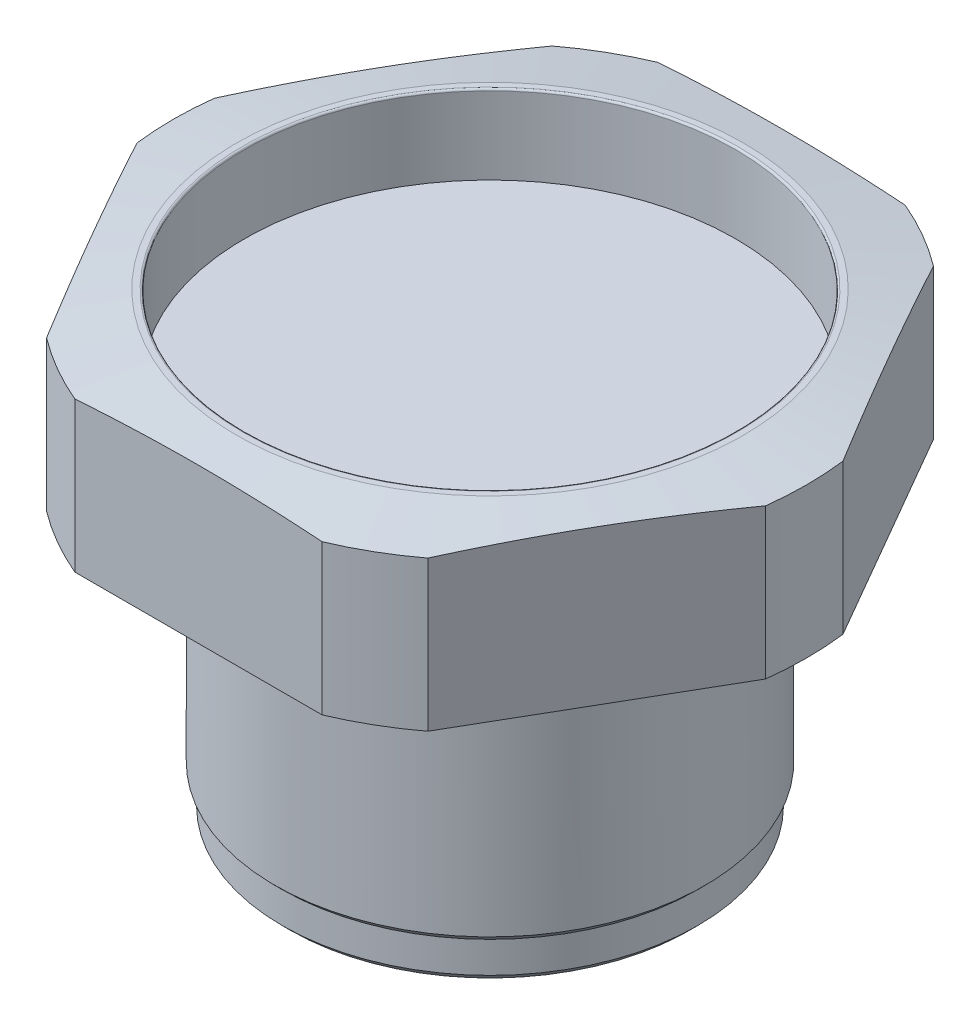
ISO-10303-21;
HEADER;
FILE_DESCRIPTION(('STEP AP214'),'2;1');
FILE_NAME('part.step','',(''),(''),'','','');
FILE_SCHEMA(('AUTOMOTIVE_DESIGN { 1 0 10303 214 1 1 1 1 }'));
ENDSEC;
DATA;
#1=APPLICATION_CONTEXT('core data for automotive mechanical design processes');
#2=APPLICATION_PROTOCOL_DEFINITION('international standard','automotive_design',2000,#1);
#3=PRODUCT_CONTEXT('',#1,'mechanical');
#4=PRODUCT('Part','Part','',(#3));
#5=PRODUCT_RELATED_PRODUCT_CATEGORY('part','',(#4));
#6=PRODUCT_DEFINITION_FORMATION('','',#4);
#7=PRODUCT_DEFINITION_CONTEXT('part definition',#1,'design');
#8=PRODUCT_DEFINITION('design','',#6,#7);
#9=PRODUCT_DEFINITION_SHAPE('','',#8);
#10=(LENGTH_UNIT() NAMED_UNIT(*) SI_UNIT(.MILLI.,.METRE.));
#11=(NAMED_UNIT(*) PLANE_ANGLE_UNIT() SI_UNIT($,.RADIAN.));
#12=(NAMED_UNIT(*) SI_UNIT($,.STERADIAN.) SOLID_ANGLE_UNIT());
#13=UNCERTAINTY_MEASURE_WITH_UNIT(LENGTH_MEASURE(1.E-05),#10,'distance_accuracy_value','');
#14=(GEOMETRIC_REPRESENTATION_CONTEXT(3) GLOBAL_UNCERTAINTY_ASSIGNED_CONTEXT((#13)) GLOBAL_UNIT_ASSIGNED_CONTEXT((#10,
#11,#12)) REPRESENTATION_CONTEXT('',''));
#15=CARTESIAN_POINT('',(0.,0.,0.));
#16=DIRECTION('',(0.,0.,1.));
#17=DIRECTION('',(1.,0.,0.));
#18=AXIS2_PLACEMENT_3D('',#15,#16,#17);
#19=CARTESIAN_POINT('',(27.0499967,-38.354,0.));
#20=DIRECTION('',(0.,-1.,0.));
#21=DIRECTION('',(0.,0.,-1.));
#22=AXIS2_PLACEMENT_3D('',#19,#20,#21);
#23=PLANE('',#22);
#24=CARTESIAN_POINT('',(0.,-38.354,0.));
#25=DIRECTION('',(0.,-1.,0.));
#26=DIRECTION('',(0.,0.,-1.));
#27=AXIS2_PLACEMENT_3D('',#24,#25,#26);
#28=CIRCLE('',#27,23.7209044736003);
#29=CARTESIAN_POINT('',(0.,-38.354,-23.7209044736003));
#30=VERTEX_POINT('',#29);
#31=EDGE_CURVE('E207',#30,#30,#28,.T.);
#32=ORIENTED_EDGE('',*,*,#31,.F.);
#33=EDGE_LOOP('',(#32));
#34=FACE_BOUND('',#33,.T.);
#35=CARTESIAN_POINT('',(0.,-38.354,0.));
#36=DIRECTION('',(0.,-1.,0.));
#37=DIRECTION('',(0.,0.,-1.));
#38=AXIS2_PLACEMENT_3D('',#35,#36,#37);
#39=CIRCLE('',#38,26.0339967);
#40=CARTESIAN_POINT('',(0.,-38.354,-26.0339967));
#41=VERTEX_POINT('',#40);
#42=EDGE_CURVE('E188',#41,#41,#39,.T.);
#43=ORIENTED_EDGE('',*,*,#42,.T.);
#44=EDGE_LOOP('',(#43));
#45=FACE_BOUND('',#44,.T.);
#46=ADVANCED_FACE('F41',(#34,#45),#23,.T.);
#47=CARTESIAN_POINT('',(0.,-8.96894233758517,0.));
#48=DIRECTION('',(0.,-1.,0.));
#49=DIRECTION('',(0.,0.,-1.));
#50=AXIS2_PLACEMENT_3D('',#47,#48,#49);
#51=CYLINDRICAL_SURFACE('',#50,27.0499967);
#52=CARTESIAN_POINT('',(0.,-0.508000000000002,0.));
#53=DIRECTION('',(0.,-1.,0.));
#54=DIRECTION('',(0.,0.,-1.));
#55=AXIS2_PLACEMENT_3D('',#52,#53,#54);
#56=CIRCLE('',#55,27.0499967);
#57=CARTESIAN_POINT('',(0.,-0.508000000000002,-27.0499967));
#58=VERTEX_POINT('',#57);
#59=EDGE_CURVE('E201',#58,#58,#56,.T.);
#60=ORIENTED_EDGE('',*,*,#59,.T.);
#61=EDGE_LOOP('',(#60));
#62=FACE_BOUND('',#61,.T.);
#63=CARTESIAN_POINT('',(0.,-5.08,0.));
#64=DIRECTION('',(0.,-1.,0.));
#65=DIRECTION('',(1.,0.,0.));
#66=AXIS2_PLACEMENT_3D('',#63,#64,#65);
#67=CIRCLE('',#66,27.0499967);
#68=CARTESIAN_POINT('',(27.0499967,-5.08,0.));
#69=VERTEX_POINT('',#68);
#70=EDGE_CURVE('E197',#69,#69,#67,.T.);
#71=ORIENTED_EDGE('',*,*,#70,.F.);
#72=EDGE_LOOP('',(#71));
#73=FACE_BOUND('',#72,.T.);
#74=ADVANCED_FACE('F228',(#62,#73),#51,.T.);
#75=CARTESIAN_POINT('',(0.,19.5502207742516,0.));
#76=DIRECTION('',(0.,-1.,0.));
#77=DIRECTION('',(0.,0.,-1.));
#78=AXIS2_PLACEMENT_3D('',#75,#76,#77);
#79=CONICAL_SURFACE('',#78,41.275,1.39626340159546);
#80=CARTESIAN_POINT('',(0.,21.0058,0.));
#81=DIRECTION('',(0.,-1.,0.));
#82=DIRECTION('',(0.,0.,-1.));
#83=AXIS2_PLACEMENT_3D('',#80,#81,#82);
#84=CIRCLE('',#83,33.02);
#85=CARTESIAN_POINT('',(0.,21.0058,-33.02));
#86=VERTEX_POINT('',#85);
#87=EDGE_CURVE('E405',#86,#86,#84,.T.);
#88=ORIENTED_EDGE('',*,*,#87,.T.);
#89=EDGE_LOOP('',(#88));
#90=FACE_BOUND('',#89,.T.);
#91=CARTESIAN_POINT('',(0.,19.5502207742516,0.));
#92=DIRECTION('',(0.,-1.,0.));
#93=DIRECTION('',(0.,0.,-1.));
#94=AXIS2_PLACEMENT_3D('',#91,#92,#93);
#95=CIRCLE('',#94,41.275);
#96=CARTESIAN_POINT('',(-40.9659173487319,19.5502207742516,5.04174977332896));
#97=VERTEX_POINT('',#96);
#98=CARTESIAN_POINT('',(-40.9659173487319,19.5502207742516,-5.04174977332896));
#99=VERTEX_POINT('',#98);
#100=EDGE_CURVE('E146',#97,#99,#95,.T.);
#101=ORIENTED_EDGE('',*,*,#100,.F.);
#102=CARTESIAN_POINT('',(-40.9673696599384,19.5500207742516,5.0392342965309));
#103=CARTESIAN_POINT('',(-40.6318536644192,19.5962299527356,5.62036504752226));
#104=CARTESIAN_POINT('',(-40.2962544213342,19.640002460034,6.20163998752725));
#105=CARTESIAN_POINT('',(-39.6248953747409,19.7223985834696,7.36446796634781));
#106=CARTESIAN_POINT('',(-39.2891355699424,19.7610221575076,7.94602100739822));
#107=CARTESIAN_POINT('',(-38.2816022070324,19.8687583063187,9.691119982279));
#108=CARTESIAN_POINT('',(-37.609604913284,19.9297320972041,10.8550534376));
#109=CARTESIAN_POINT('',(-36.2660437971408,20.0280404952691,13.182169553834));
#110=CARTESIAN_POINT('',(-35.5944805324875,20.0654054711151,14.3453512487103));
#111=CARTESIAN_POINT('',(-34.251138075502,20.1153717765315,16.6720886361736));
#112=CARTESIAN_POINT('',(-33.5793588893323,20.127973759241,17.8356443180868));
#113=CARTESIAN_POINT('',(-32.2358005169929,20.127973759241,20.1627556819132));
#114=CARTESIAN_POINT('',(-31.5640213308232,20.1153717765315,21.3263113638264));
#115=CARTESIAN_POINT('',(-30.2206788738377,20.0654054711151,23.6530487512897));
#116=CARTESIAN_POINT('',(-29.5491156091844,20.0280404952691,24.816230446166));
#117=CARTESIAN_POINT('',(-28.2055544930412,19.9297320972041,27.1433465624));
#118=CARTESIAN_POINT('',(-27.5335571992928,19.8687583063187,28.307280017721));
#119=CARTESIAN_POINT('',(-26.5260238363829,19.7610221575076,30.0523789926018));
#120=CARTESIAN_POINT('',(-26.1902640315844,19.7223985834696,30.6339320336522));
#121=CARTESIAN_POINT('',(-25.5189049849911,19.640002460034,31.7967600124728));
#122=CARTESIAN_POINT('',(-25.183305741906,19.5962299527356,32.3780349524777));
#123=CARTESIAN_POINT('',(-24.8477897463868,19.5500207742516,32.9591657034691));
#124=B_SPLINE_CURVE_WITH_KNOTS('',3,(#102,#103,#104,#105,#106,#107,#108,#109,#110,#111,#112,
#113,#114,#115,#116,#117,#118,#119,#120,#121,#122,#123),.UNSPECIFIED.,.F.,.F.,(4,2,2,2,2,2,2,2,
2,2,4),(0.,2.01785524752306,4.03572699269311,8.07165217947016,12.1023752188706,16.132991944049,
20.1636086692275,24.1943317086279,28.230256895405,30.248128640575,32.2659838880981),.UNSPECIFIED.);
#125=CARTESIAN_POINT('',(-24.8492420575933,19.5502207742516,32.956650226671));
#126=VERTEX_POINT('',#125);
#127=EDGE_CURVE('E404',#97,#126,#124,.T.);
#128=ORIENTED_EDGE('',*,*,#127,.T.);
#129=CARTESIAN_POINT('',(-16.1166752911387,19.5502207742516,37.9984));
#130=VERTEX_POINT('',#129);
#131=EDGE_CURVE('E396',#130,#126,#95,.T.);
#132=ORIENTED_EDGE('',*,*,#131,.F.);
#133=CARTESIAN_POINT('',(-57.8639051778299,14.6218698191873,37.9984));
#134=CARTESIAN_POINT('',(-57.0019930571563,14.7489031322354,37.9984));
#135=CARTESIAN_POINT('',(-56.139958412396,14.8751046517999,37.9984));
#136=CARTESIAN_POINT('',(-54.4156199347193,15.125664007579,37.9984));
#137=CARTESIAN_POINT('',(-53.5533161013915,15.2500218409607,37.9984));
#138=CARTESIAN_POINT('',(-50.9659374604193,15.6200635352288,37.9984));
#139=CARTESIAN_POINT('',(-49.2404266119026,15.8627109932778,37.9984));
#140=CARTESIAN_POINT('',(-45.7873021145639,16.3382293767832,37.9984));
#141=CARTESIAN_POINT('',(-44.0596878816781,16.5710960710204,37.9984));
#142=CARTESIAN_POINT('',(-40.6028670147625,17.0246892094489,37.9984));
#143=CARTESIAN_POINT('',(-38.8736603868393,17.245415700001,37.9984));
#144=CARTESIAN_POINT('',(-35.419217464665,17.6711956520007,37.9984));
#145=CARTESIAN_POINT('',(-33.6939873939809,17.8762993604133,37.9984));
#146=CARTESIAN_POINT('',(-30.2414345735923,18.2682133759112,37.9984));
#147=CARTESIAN_POINT('',(-28.5141118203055,18.4550236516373,37.9984));
#148=CARTESIAN_POINT('',(-25.0572784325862,18.8062070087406,37.9984));
#149=CARTESIAN_POINT('',(-23.3277679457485,18.9705815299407,37.9984));
#150=CARTESIAN_POINT('',(-19.8663595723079,19.2721663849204,37.9984));
#151=CARTESIAN_POINT('',(-18.1344616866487,19.4093767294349,37.9984));
#152=CARTESIAN_POINT('',(-14.6602163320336,19.6521327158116,37.9984));
#153=CARTESIAN_POINT('',(-12.9178580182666,19.7575264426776,37.9984));
#154=CARTESIAN_POINT('',(-10.3029433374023,19.8876204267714,37.9984));
#155=CARTESIAN_POINT('',(-9.43107075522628,19.9263191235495,37.9984));
#156=CARTESIAN_POINT('',(-7.68694739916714,19.9938955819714,37.9984));
#157=CARTESIAN_POINT('',(-6.81469662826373,20.0227734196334,37.9984));
#158=CARTESIAN_POINT('',(-5.0700654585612,20.0703033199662,37.9984));
#159=CARTESIAN_POINT('',(-4.19768510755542,20.0889571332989,37.9984));
#160=CARTESIAN_POINT('',(-2.45276864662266,20.1157789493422,37.9984));
#161=CARTESIAN_POINT('',(-1.58023253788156,20.1239470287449,37.9984));
#162=CARTESIAN_POINT('',(0.164877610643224,20.1296767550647,37.9984));
#163=CARTESIAN_POINT('',(1.03745165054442,20.1272383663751,37.9984));
#164=CARTESIAN_POINT('',(2.78250560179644,20.1117916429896,37.9984));
#165=CARTESIAN_POINT('',(3.65498551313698,20.0987833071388,37.9984));
#166=CARTESIAN_POINT('',(5.40109406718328,20.0623572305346,37.9984));
#167=CARTESIAN_POINT('',(6.27472237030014,20.0389232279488,37.9984));
#168=CARTESIAN_POINT('',(8.0216525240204,19.9819781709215,37.9984));
#169=CARTESIAN_POINT('',(8.89495437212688,19.9484670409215,37.9984));
#170=CARTESIAN_POINT('',(11.5142177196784,19.833470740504,37.9984));
#171=CARTESIAN_POINT('',(13.2595585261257,19.7375221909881,37.9984));
#172=CARTESIAN_POINT('',(16.748434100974,19.5116068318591,37.9984));
#173=CARTESIAN_POINT('',(18.4919682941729,19.3816313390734,37.9984));
#174=CARTESIAN_POINT('',(21.9766261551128,19.0928384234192,37.9984));
#175=CARTESIAN_POINT('',(23.7177498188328,18.9340209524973,37.9984));
#176=CARTESIAN_POINT('',(27.1033127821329,18.6017526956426,37.9984));
#177=CARTESIAN_POINT('',(28.7478770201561,18.4295617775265,37.9984));
#178=CARTESIAN_POINT('',(32.0350715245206,18.0675285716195,37.9984));
#179=CARTESIAN_POINT('',(33.6777017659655,17.8776860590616,37.9984));
#180=CARTESIAN_POINT('',(36.9612926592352,17.4835029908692,37.9984));
#181=CARTESIAN_POINT('',(38.6022532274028,17.279161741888,37.9984));
#182=CARTESIAN_POINT('',(41.8826385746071,16.8585980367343,37.9984));
#183=CARTESIAN_POINT('',(43.5220633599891,16.6423756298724,37.9984));
#184=CARTESIAN_POINT('',(46.7998380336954,16.2001333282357,37.9984));
#185=CARTESIAN_POINT('',(48.4381877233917,15.974111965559,37.9984));
#186=CARTESIAN_POINT('',(51.7137535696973,15.5140087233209,37.9984));
#187=CARTESIAN_POINT('',(53.3509697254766,15.2799268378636,37.9984));
#188=CARTESIAN_POINT('',(56.624382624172,14.805081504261,37.9984));
#189=CARTESIAN_POINT('',(58.2605793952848,14.5643182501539,37.9984));
#190=CARTESIAN_POINT('',(61.5321396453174,14.0772070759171,37.9984));
#191=CARTESIAN_POINT('',(63.1675031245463,13.8308591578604,37.9984));
#192=CARTESIAN_POINT('',(66.430533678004,13.3345330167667,37.9984));
#193=CARTESIAN_POINT('',(68.0582037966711,13.0845747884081,37.9984));
#194=CARTESIAN_POINT('',(71.3129338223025,12.5807143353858,37.9984));
#195=CARTESIAN_POINT('',(72.9399937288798,12.3268121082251,37.9984));
#196=CARTESIAN_POINT('',(77.8204109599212,11.5600905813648,37.9984));
#197=CARTESIAN_POINT('',(81.07298140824,11.0422601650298,37.9984));
#198=CARTESIAN_POINT('',(85.9496272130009,10.2582808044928,37.9984));
#199=CARTESIAN_POINT('',(87.5742999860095,9.99583189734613,37.9984));
#200=CARTESIAN_POINT('',(90.8232964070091,9.46877892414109,37.9984));
#201=CARTESIAN_POINT('',(92.4476200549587,9.20417485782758,37.9984));
#202=CARTESIAN_POINT('',(95.6959355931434,8.67309809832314,37.9984));
#203=CARTESIAN_POINT('',(97.3199274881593,8.40662543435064,37.9984));
#204=CARTESIAN_POINT('',(100.567638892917,7.87203038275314,37.9984));
#205=CARTESIAN_POINT('',(102.191358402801,7.60390799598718,37.9984));
#206=CARTESIAN_POINT('',(103.814959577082,7.33507210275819,37.9984));
#207=B_SPLINE_CURVE_WITH_KNOTS('',3,(#133,#134,#135,#136,#137,#138,#139,#140,#141,#142,#143,
#144,#145,#146,#147,#148,#149,#150,#151,#152,#153,#154,#155,#156,#157,#158,#159,#160,#161,#162,
#163,#164,#165,#166,#167,#168,#169,#170,#171,#172,#173,#174,#175,#176,#177,#178,#179,#180,#181,
#182,#183,#184,#185,#186,#187,#188,#189,#190,#191,#192,#193,#194,#195,#196,#197,#198,#199,#200,
#201,#202,#203,#204,#205,#206),.UNSPECIFIED.,.F.,.F.,(4,2,2,2,2,2,2,2,2,2,2,2,2,2,2,2,2,2,2,2,2,
2,2,2,2,2,2,2,2,2,2,2,2,2,2,2,4),(0.,2.6136690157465,5.22734204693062,10.454782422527,
15.6844614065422,20.9141204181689,26.1261792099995,31.3382469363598,36.549980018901,
41.7617110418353,46.9979466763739,49.6160934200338,52.2342198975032,54.8518979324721,
57.4695568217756,60.0872244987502,62.7048924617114,65.3266578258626,67.9484428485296,
73.1919483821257,78.4367932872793,83.681646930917,88.6421976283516,93.602811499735,
98.5636627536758,103.524493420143,108.486069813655,113.447649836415,118.409085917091,
123.37052015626,128.310767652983,133.251018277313,143.131593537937,148.068795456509,
153.005997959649,157.943123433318,162.880246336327),.UNSPECIFIED.);
#208=CARTESIAN_POINT('',(16.1166752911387,19.5502207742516,37.9984));
#209=VERTEX_POINT('',#208);
#210=EDGE_CURVE('E297',#130,#209,#207,.T.);
#211=ORIENTED_EDGE('',*,*,#210,.T.);
#212=CARTESIAN_POINT('',(24.8492420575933,19.5502207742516,32.956650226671));
#213=VERTEX_POINT('',#212);
#214=EDGE_CURVE('E366',#213,#209,#95,.T.);
#215=ORIENTED_EDGE('',*,*,#214,.F.);
#216=CARTESIAN_POINT('',(24.8477897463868,19.5500207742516,32.9591657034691));
#217=CARTESIAN_POINT('',(25.183305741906,19.5962299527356,32.3780349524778));
#218=CARTESIAN_POINT('',(25.5189049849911,19.640002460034,31.7967600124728));
#219=CARTESIAN_POINT('',(26.1902640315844,19.7223985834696,30.6339320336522));
#220=CARTESIAN_POINT('',(26.5260238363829,19.7610221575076,30.0523789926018));
#221=CARTESIAN_POINT('',(27.5335571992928,19.8687583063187,28.307280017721));
#222=CARTESIAN_POINT('',(28.2055544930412,19.9297320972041,27.1433465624));
#223=CARTESIAN_POINT('',(29.5491156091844,20.0280404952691,24.8162304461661));
#224=CARTESIAN_POINT('',(30.2206788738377,20.0654054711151,23.6530487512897));
#225=CARTESIAN_POINT('',(31.5640213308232,20.1153717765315,21.3263113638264));
#226=CARTESIAN_POINT('',(32.2358005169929,20.127973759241,20.1627556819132));
#227=CARTESIAN_POINT('',(33.5793588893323,20.127973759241,17.8356443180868));
#228=CARTESIAN_POINT('',(34.251138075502,20.1153717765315,16.6720886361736));
#229=CARTESIAN_POINT('',(35.5944805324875,20.0654054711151,14.3453512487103));
#230=CARTESIAN_POINT('',(36.2660437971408,20.0280404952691,13.182169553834));
#231=CARTESIAN_POINT('',(37.609604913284,19.9297320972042,10.8550534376));
#232=CARTESIAN_POINT('',(38.2816022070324,19.8687583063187,9.69111998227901));
#233=CARTESIAN_POINT('',(39.2891355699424,19.7610221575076,7.94602100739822));
#234=CARTESIAN_POINT('',(39.6248953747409,19.7223985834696,7.36446796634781));
#235=CARTESIAN_POINT('',(40.2962544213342,19.640002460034,6.20163998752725));
#236=CARTESIAN_POINT('',(40.6318536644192,19.5962299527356,5.62036504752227));
#237=CARTESIAN_POINT('',(40.9673696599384,19.5500207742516,5.0392342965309));
#238=B_SPLINE_CURVE_WITH_KNOTS('',3,(#216,#217,#218,#219,#220,#221,#222,#223,#224,#225,#226,
#227,#228,#229,#230,#231,#232,#233,#234,#235,#236,#237),.UNSPECIFIED.,.F.,.F.,(4,2,2,2,2,2,2,2,
2,2,4),(0.,2.01785524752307,4.03572699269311,8.07165217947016,12.1023752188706,16.132991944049,
20.1636086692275,24.1943317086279,28.230256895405,30.248128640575,32.2659838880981),.UNSPECIFIED.);
#239=CARTESIAN_POINT('',(40.9659173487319,19.5502207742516,5.04174977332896));
#240=VERTEX_POINT('',#239);
#241=EDGE_CURVE('E349',#213,#240,#238,.T.);
#242=ORIENTED_EDGE('',*,*,#241,.T.);
#243=CARTESIAN_POINT('',(40.9659173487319,19.5502207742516,-5.04174977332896));
#244=VERTEX_POINT('',#243);
#245=EDGE_CURVE('E169',#244,#240,#95,.T.);
#246=ORIENTED_EDGE('',*,*,#245,.F.);
#247=CARTESIAN_POINT('',(40.9673696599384,19.5500207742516,-5.0392342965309));
#248=CARTESIAN_POINT('',(40.6318536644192,19.5962299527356,-5.62036504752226));
#249=CARTESIAN_POINT('',(40.2962544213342,19.640002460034,-6.20163998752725));
#250=CARTESIAN_POINT('',(39.6248953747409,19.7223985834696,-7.36446796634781));
#251=CARTESIAN_POINT('',(39.2891355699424,19.7610221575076,-7.94602100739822));
#252=CARTESIAN_POINT('',(38.2816022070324,19.8687583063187,-9.691119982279));
#253=CARTESIAN_POINT('',(37.609604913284,19.9297320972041,-10.8550534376));
#254=CARTESIAN_POINT('',(36.2660437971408,20.0280404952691,-13.182169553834));
#255=CARTESIAN_POINT('',(35.5944805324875,20.0654054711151,-14.3453512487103));
#256=CARTESIAN_POINT('',(34.251138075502,20.1153717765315,-16.6720886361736));
#257=CARTESIAN_POINT('',(33.5793588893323,20.127973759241,-17.8356443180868));
#258=CARTESIAN_POINT('',(32.2358005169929,20.127973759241,-20.1627556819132));
#259=CARTESIAN_POINT('',(31.5640213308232,20.1153717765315,-21.3263113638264));
#260=CARTESIAN_POINT('',(30.2206788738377,20.0654054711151,-23.6530487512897));
#261=CARTESIAN_POINT('',(29.5491156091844,20.0280404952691,-24.816230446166));
#262=CARTESIAN_POINT('',(28.2055544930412,19.9297320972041,-27.1433465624));
#263=CARTESIAN_POINT('',(27.5335571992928,19.8687583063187,-28.307280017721));
#264=CARTESIAN_POINT('',(26.5260238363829,19.7610221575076,-30.0523789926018));
#265=CARTESIAN_POINT('',(26.1902640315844,19.7223985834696,-30.6339320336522));
#266=CARTESIAN_POINT('',(25.5189049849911,19.640002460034,-31.7967600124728));
#267=CARTESIAN_POINT('',(25.183305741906,19.5962299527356,-32.3780349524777));
#268=CARTESIAN_POINT('',(24.8477897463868,19.5500207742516,-32.9591657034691));
#269=B_SPLINE_CURVE_WITH_KNOTS('',3,(#247,#248,#249,#250,#251,#252,#253,#254,#255,#256,#257,
#258,#259,#260,#261,#262,#263,#264,#265,#266,#267,#268),.UNSPECIFIED.,.F.,.F.,(4,2,2,2,2,2,2,2,
2,2,4),(0.,2.01785524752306,4.03572699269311,8.07165217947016,12.1023752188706,16.132991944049,
20.1636086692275,24.1943317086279,28.230256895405,30.248128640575,32.2659838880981),.UNSPECIFIED.);
#270=CARTESIAN_POINT('',(24.8492420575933,19.5502207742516,-32.956650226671));
#271=VERTEX_POINT('',#270);
#272=EDGE_CURVE('E341',#244,#271,#269,.T.);
#273=ORIENTED_EDGE('',*,*,#272,.T.);
#274=CARTESIAN_POINT('',(16.1166752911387,19.5502207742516,-37.9984));
#275=VERTEX_POINT('',#274);
#276=EDGE_CURVE('E165',#275,#271,#95,.T.);
#277=ORIENTED_EDGE('',*,*,#276,.F.);
#278=CARTESIAN_POINT('',(-57.8639051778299,14.6218698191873,-37.9984));
#279=CARTESIAN_POINT('',(-57.0019930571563,14.7489031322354,-37.9984));
#280=CARTESIAN_POINT('',(-56.139958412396,14.8751046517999,-37.9984));
#281=CARTESIAN_POINT('',(-54.4156199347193,15.125664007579,-37.9984));
#282=CARTESIAN_POINT('',(-53.5533161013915,15.2500218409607,-37.9984));
#283=CARTESIAN_POINT('',(-50.9659374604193,15.6200635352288,-37.9984));
#284=CARTESIAN_POINT('',(-49.2404266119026,15.8627109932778,-37.9984));
#285=CARTESIAN_POINT('',(-45.7873021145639,16.3382293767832,-37.9984));
#286=CARTESIAN_POINT('',(-44.0596878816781,16.5710960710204,-37.9984));
#287=CARTESIAN_POINT('',(-40.6028670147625,17.0246892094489,-37.9984));
#288=CARTESIAN_POINT('',(-38.8736603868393,17.245415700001,-37.9984));
#289=CARTESIAN_POINT('',(-35.419217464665,17.6711956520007,-37.9984));
#290=CARTESIAN_POINT('',(-33.6939873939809,17.8762993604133,-37.9984));
#291=CARTESIAN_POINT('',(-30.2414345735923,18.2682133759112,-37.9984));
#292=CARTESIAN_POINT('',(-28.5141118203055,18.4550236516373,-37.9984));
#293=CARTESIAN_POINT('',(-25.0572784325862,18.8062070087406,-37.9984));
#294=CARTESIAN_POINT('',(-23.3277679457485,18.9705815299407,-37.9984));
#295=CARTESIAN_POINT('',(-19.8663595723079,19.2721663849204,-37.9984));
#296=CARTESIAN_POINT('',(-18.1344616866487,19.4093767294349,-37.9984));
#297=CARTESIAN_POINT('',(-14.6602163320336,19.6521327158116,-37.9984));
#298=CARTESIAN_POINT('',(-12.9178580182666,19.7575264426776,-37.9984));
#299=CARTESIAN_POINT('',(-10.3029433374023,19.8876204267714,-37.9984));
#300=CARTESIAN_POINT('',(-9.43107075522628,19.9263191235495,-37.9984));
#301=CARTESIAN_POINT('',(-7.68694739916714,19.9938955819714,-37.9984));
#302=CARTESIAN_POINT('',(-6.81469662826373,20.0227734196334,-37.9984));
#303=CARTESIAN_POINT('',(-5.0700654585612,20.0703033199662,-37.9984));
#304=CARTESIAN_POINT('',(-4.19768510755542,20.0889571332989,-37.9984));
#305=CARTESIAN_POINT('',(-2.45276864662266,20.1157789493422,-37.9984));
#306=CARTESIAN_POINT('',(-1.58023253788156,20.1239470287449,-37.9984));
#307=CARTESIAN_POINT('',(0.164877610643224,20.1296767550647,-37.9984));
#308=CARTESIAN_POINT('',(1.03745165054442,20.1272383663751,-37.9984));
#309=CARTESIAN_POINT('',(2.78250560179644,20.1117916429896,-37.9984));
#310=CARTESIAN_POINT('',(3.65498551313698,20.0987833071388,-37.9984));
#311=CARTESIAN_POINT('',(5.40109406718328,20.0623572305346,-37.9984));
#312=CARTESIAN_POINT('',(6.27472237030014,20.0389232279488,-37.9984));
#313=CARTESIAN_POINT('',(8.0216525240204,19.9819781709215,-37.9984));
#314=CARTESIAN_POINT('',(8.89495437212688,19.9484670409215,-37.9984));
#315=CARTESIAN_POINT('',(11.5142177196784,19.833470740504,-37.9984));
#316=CARTESIAN_POINT('',(13.2595585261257,19.7375221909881,-37.9984));
#317=CARTESIAN_POINT('',(16.748434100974,19.5116068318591,-37.9984));
#318=CARTESIAN_POINT('',(18.4919682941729,19.3816313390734,-37.9984));
#319=CARTESIAN_POINT('',(21.9766261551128,19.0928384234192,-37.9984));
#320=CARTESIAN_POINT('',(23.7177498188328,18.9340209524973,-37.9984));
#321=CARTESIAN_POINT('',(27.1033127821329,18.6017526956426,-37.9984));
#322=CARTESIAN_POINT('',(28.7478770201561,18.4295617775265,-37.9984));
#323=CARTESIAN_POINT('',(32.0350715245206,18.0675285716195,-37.9984));
#324=CARTESIAN_POINT('',(33.6777017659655,17.8776860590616,-37.9984));
#325=CARTESIAN_POINT('',(36.9612926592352,17.4835029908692,-37.9984));
#326=CARTESIAN_POINT('',(38.6022532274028,17.279161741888,-37.9984));
#327=CARTESIAN_POINT('',(41.8826385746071,16.8585980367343,-37.9984));
#328=CARTESIAN_POINT('',(43.5220633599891,16.6423756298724,-37.9984));
#329=CARTESIAN_POINT('',(46.7998380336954,16.2001333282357,-37.9984));
#330=CARTESIAN_POINT('',(48.4381877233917,15.974111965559,-37.9984));
#331=CARTESIAN_POINT('',(51.7137535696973,15.5140087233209,-37.9984));
#332=CARTESIAN_POINT('',(53.3509697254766,15.2799268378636,-37.9984));
#333=CARTESIAN_POINT('',(56.624382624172,14.805081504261,-37.9984));
#334=CARTESIAN_POINT('',(58.2605793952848,14.5643182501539,-37.9984));
#335=CARTESIAN_POINT('',(61.5321396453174,14.0772070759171,-37.9984));
#336=CARTESIAN_POINT('',(63.1675031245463,13.8308591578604,-37.9984));
#337=CARTESIAN_POINT('',(66.430533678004,13.3345330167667,-37.9984));
#338=CARTESIAN_POINT('',(68.0582037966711,13.0845747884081,-37.9984));
#339=CARTESIAN_POINT('',(71.3129338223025,12.5807143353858,-37.9984));
#340=CARTESIAN_POINT('',(72.9399937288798,12.3268121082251,-37.9984));
#341=CARTESIAN_POINT('',(77.8204109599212,11.5600905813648,-37.9984));
#342=CARTESIAN_POINT('',(81.07298140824,11.0422601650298,-37.9984));
#343=CARTESIAN_POINT('',(85.9496272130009,10.2582808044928,-37.9984));
#344=CARTESIAN_POINT('',(87.5742999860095,9.99583189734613,-37.9984));
#345=CARTESIAN_POINT('',(90.8232964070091,9.46877892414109,-37.9984));
#346=CARTESIAN_POINT('',(92.4476200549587,9.20417485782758,-37.9984));
#347=CARTESIAN_POINT('',(95.6959355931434,8.67309809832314,-37.9984));
#348=CARTESIAN_POINT('',(97.3199274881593,8.40662543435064,-37.9984));
#349=CARTESIAN_POINT('',(100.567638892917,7.87203038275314,-37.9984));
#350=CARTESIAN_POINT('',(102.191358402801,7.60390799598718,-37.9984));
#351=CARTESIAN_POINT('',(103.814959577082,7.33507210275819,-37.9984));
#352=B_SPLINE_CURVE_WITH_KNOTS('',3,(#278,#279,#280,#281,#282,#283,#284,#285,#286,#287,#288,
#289,#290,#291,#292,#293,#294,#295,#296,#297,#298,#299,#300,#301,#302,#303,#304,#305,#306,#307,
#308,#309,#310,#311,#312,#313,#314,#315,#316,#317,#318,#319,#320,#321,#322,#323,#324,#325,#326,
#327,#328,#329,#330,#331,#332,#333,#334,#335,#336,#337,#338,#339,#340,#341,#342,#343,#344,#345,
#346,#347,#348,#349,#350,#351),.UNSPECIFIED.,.F.,.F.,(4,2,2,2,2,2,2,2,2,2,2,2,2,2,2,2,2,2,2,2,2,
2,2,2,2,2,2,2,2,2,2,2,2,2,2,2,4),(0.,2.6136690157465,5.22734204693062,10.454782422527,
15.6844614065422,20.9141204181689,26.1261792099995,31.3382469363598,36.549980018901,
41.7617110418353,46.9979466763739,49.6160934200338,52.2342198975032,54.8518979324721,
57.4695568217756,60.0872244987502,62.7048924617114,65.3266578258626,67.9484428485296,
73.1919483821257,78.4367932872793,83.681646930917,88.6421976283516,93.602811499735,
98.5636627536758,103.524493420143,108.486069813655,113.447649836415,118.409085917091,
123.37052015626,128.310767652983,133.251018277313,143.131593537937,148.068795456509,
153.005997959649,157.943123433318,162.880246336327),.UNSPECIFIED.);
#353=CARTESIAN_POINT('',(-16.1166752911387,19.5502207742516,-37.9984));
#354=VERTEX_POINT('',#353);
#355=EDGE_CURVE('E331',#275,#354,#352,.F.);
#356=ORIENTED_EDGE('',*,*,#355,.T.);
#357=CARTESIAN_POINT('',(-24.8492420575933,19.5502207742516,-32.956650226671));
#358=VERTEX_POINT('',#357);
#359=EDGE_CURVE('E162',#358,#354,#95,.T.);
#360=ORIENTED_EDGE('',*,*,#359,.F.);
#361=CARTESIAN_POINT('',(-24.8477897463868,19.5500207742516,-32.9591657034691));
#362=CARTESIAN_POINT('',(-25.183305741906,19.5962299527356,-32.3780349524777));
#363=CARTESIAN_POINT('',(-25.5189049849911,19.640002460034,-31.7967600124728));
#364=CARTESIAN_POINT('',(-26.1902640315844,19.7223985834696,-30.6339320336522));
#365=CARTESIAN_POINT('',(-26.5260238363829,19.7610221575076,-30.0523789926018));
#366=CARTESIAN_POINT('',(-27.5335571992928,19.8687583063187,-28.307280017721));
#367=CARTESIAN_POINT('',(-28.2055544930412,19.9297320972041,-27.1433465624));
#368=CARTESIAN_POINT('',(-29.5491156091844,20.0280404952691,-24.816230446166));
#369=CARTESIAN_POINT('',(-30.2206788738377,20.0654054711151,-23.6530487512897));
#370=CARTESIAN_POINT('',(-31.5640213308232,20.1153717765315,-21.3263113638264));
#371=CARTESIAN_POINT('',(-32.2358005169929,20.127973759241,-20.1627556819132));
#372=CARTESIAN_POINT('',(-33.5793588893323,20.127973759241,-17.8356443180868));
#373=CARTESIAN_POINT('',(-34.251138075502,20.1153717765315,-16.6720886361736));
#374=CARTESIAN_POINT('',(-35.5944805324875,20.0654054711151,-14.3453512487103));
#375=CARTESIAN_POINT('',(-36.2660437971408,20.0280404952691,-13.182169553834));
#376=CARTESIAN_POINT('',(-37.609604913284,19.9297320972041,-10.8550534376));
#377=CARTESIAN_POINT('',(-38.2816022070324,19.8687583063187,-9.69111998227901));
#378=CARTESIAN_POINT('',(-39.2891355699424,19.7610221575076,-7.94602100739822));
#379=CARTESIAN_POINT('',(-39.6248953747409,19.7223985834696,-7.36446796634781));
#380=CARTESIAN_POINT('',(-40.2962544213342,19.640002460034,-6.20163998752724));
#381=CARTESIAN_POINT('',(-40.6318536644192,19.5962299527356,-5.62036504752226));
#382=CARTESIAN_POINT('',(-40.9673696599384,19.5500207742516,-5.03923429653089));
#383=B_SPLINE_CURVE_WITH_KNOTS('',3,(#361,#362,#363,#364,#365,#366,#367,#368,#369,#370,#371,
#372,#373,#374,#375,#376,#377,#378,#379,#380,#381,#382),.UNSPECIFIED.,.F.,.F.,(4,2,2,2,2,2,2,2,
2,2,4),(0.,2.01785524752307,4.03572699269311,8.07165217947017,12.1023752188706,16.132991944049,
20.1636086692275,24.1943317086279,28.230256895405,30.248128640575,32.2659838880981),.UNSPECIFIED.);
#384=EDGE_CURVE('E147',#358,#99,#383,.T.);
#385=ORIENTED_EDGE('',*,*,#384,.T.);
#386=EDGE_LOOP('',(#101,#128,#132,#211,#215,#242,#246,#273,#277,#356,#360,#385));
#387=FACE_BOUND('',#386,.T.);
#388=ADVANCED_FACE('F235',(#90,#387),#79,.T.);
#389=CARTESIAN_POINT('',(0.,-8.96894233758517,0.));
#390=DIRECTION('',(0.,-1.,0.));
#391=DIRECTION('',(0.,0.,-1.));
#392=AXIS2_PLACEMENT_3D('',#389,#390,#391);
#393=CYLINDRICAL_SURFACE('',#392,41.275);
#394=CARTESIAN_POINT('',(0.,0.,0.));
#395=DIRECTION('',(0.,-1.,0.));
#396=DIRECTION('',(0.,0.,-1.));
#397=AXIS2_PLACEMENT_3D('',#394,#395,#396);
#398=CIRCLE('',#397,41.275);
#399=CARTESIAN_POINT('',(-40.9659173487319,0.,5.04174977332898));
#400=VERTEX_POINT('',#399);
#401=CARTESIAN_POINT('',(-40.9659173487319,0.,-5.04174977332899));
#402=VERTEX_POINT('',#401);
#403=EDGE_CURVE('E144',#400,#402,#398,.T.);
#404=ORIENTED_EDGE('',*,*,#403,.F.);
#405=DIRECTION('',(0.,-1.,0.));
#406=VECTOR('',#405,1.);
#407=CARTESIAN_POINT('',(-40.9659173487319,-8.96894233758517,5.04174977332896));
#408=LINE('',#407,#406);
#409=EDGE_CURVE('E64',#400,#97,#408,.F.);
#410=ORIENTED_EDGE('',*,*,#409,.T.);
#411=ORIENTED_EDGE('',*,*,#100,.T.);
#412=DIRECTION('',(0.,-1.,0.));
#413=VECTOR('',#412,1.);
#414=CARTESIAN_POINT('',(-40.9659173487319,-8.96894233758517,-5.04174977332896));
#415=LINE('',#414,#413);
#416=EDGE_CURVE('E130',#99,#402,#415,.T.);
#417=ORIENTED_EDGE('',*,*,#416,.T.);
#418=EDGE_LOOP('',(#404,#410,#411,#417));
#419=FACE_BOUND('',#418,.T.);
#420=ADVANCED_FACE('F143',(#419),#393,.T.);
#421=ORIENTED_EDGE('',*,*,#131,.T.);
#422=DIRECTION('',(0.,-1.,0.));
#423=VECTOR('',#422,1.);
#424=CARTESIAN_POINT('',(-24.8492420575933,-8.96894233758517,32.956650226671));
#425=LINE('',#424,#423);
#426=CARTESIAN_POINT('',(-24.8492420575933,0.,32.956650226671));
#427=VERTEX_POINT('',#426);
#428=EDGE_CURVE('E403',#126,#427,#425,.T.);
#429=ORIENTED_EDGE('',*,*,#428,.T.);
#430=CARTESIAN_POINT('',(-16.1166752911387,0.,37.9984));
#431=VERTEX_POINT('',#430);
#432=EDGE_CURVE('E153',#431,#427,#398,.T.);
#433=ORIENTED_EDGE('',*,*,#432,.F.);
#434=DIRECTION('',(0.,-1.,0.));
#435=VECTOR('',#434,1.);
#436=CARTESIAN_POINT('',(-16.1166752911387,-8.96894233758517,37.9984));
#437=LINE('',#436,#435);
#438=EDGE_CURVE('E306',#431,#130,#437,.F.);
#439=ORIENTED_EDGE('',*,*,#438,.T.);
#440=EDGE_LOOP('',(#421,#429,#433,#439));
#441=FACE_BOUND('',#440,.T.);
#442=ADVANCED_FACE('F402',(#441),#393,.T.);
#443=ORIENTED_EDGE('',*,*,#214,.T.);
#444=DIRECTION('',(0.,-1.,0.));
#445=VECTOR('',#444,1.);
#446=CARTESIAN_POINT('',(16.1166752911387,-8.96894233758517,37.9984));
#447=LINE('',#446,#445);
#448=CARTESIAN_POINT('',(16.1166752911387,0.,37.9984));
#449=VERTEX_POINT('',#448);
#450=EDGE_CURVE('E307',#209,#449,#447,.T.);
#451=ORIENTED_EDGE('',*,*,#450,.T.);
#452=CARTESIAN_POINT('',(24.8492420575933,0.,32.956650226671));
#453=VERTEX_POINT('',#452);
#454=EDGE_CURVE('E156',#453,#449,#398,.T.);
#455=ORIENTED_EDGE('',*,*,#454,.F.);
#456=DIRECTION('',(0.,-1.,0.));
#457=VECTOR('',#456,1.);
#458=CARTESIAN_POINT('',(24.8492420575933,-8.96894233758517,32.956650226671));
#459=LINE('',#458,#457);
#460=EDGE_CURVE('E356',#453,#213,#459,.F.);
#461=ORIENTED_EDGE('',*,*,#460,.T.);
#462=EDGE_LOOP('',(#443,#451,#455,#461));
#463=FACE_BOUND('',#462,.T.);
#464=ADVANCED_FACE('F365',(#463),#393,.T.);
#465=ORIENTED_EDGE('',*,*,#245,.T.);
#466=DIRECTION('',(0.,-1.,0.));
#467=VECTOR('',#466,1.);
#468=CARTESIAN_POINT('',(40.9659173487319,-8.96894233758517,5.04174977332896));
#469=LINE('',#468,#467);
#470=CARTESIAN_POINT('',(40.9659173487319,0.,5.04174977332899));
#471=VERTEX_POINT('',#470);
#472=EDGE_CURVE('E357',#240,#471,#469,.T.);
#473=ORIENTED_EDGE('',*,*,#472,.T.);
#474=CARTESIAN_POINT('',(40.9659173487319,0.,-5.041749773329));
#475=VERTEX_POINT('',#474);
#476=EDGE_CURVE('E163',#475,#471,#398,.T.);
#477=ORIENTED_EDGE('',*,*,#476,.F.);
#478=DIRECTION('',(0.,-1.,0.));
#479=VECTOR('',#478,1.);
#480=CARTESIAN_POINT('',(40.9659173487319,-8.96894233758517,-5.04174977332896));
#481=LINE('',#480,#479);
#482=EDGE_CURVE('E375',#475,#244,#481,.F.);
#483=ORIENTED_EDGE('',*,*,#482,.T.);
#484=EDGE_LOOP('',(#465,#473,#477,#483));
#485=FACE_BOUND('',#484,.T.);
#486=ADVANCED_FACE('F374',(#485),#393,.T.);
#487=ORIENTED_EDGE('',*,*,#276,.T.);
#488=DIRECTION('',(0.,-1.,0.));
#489=VECTOR('',#488,1.);
#490=CARTESIAN_POINT('',(24.8492420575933,-8.96894233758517,-32.956650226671));
#491=LINE('',#490,#489);
#492=CARTESIAN_POINT('',(24.8492420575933,0.,-32.956650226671));
#493=VERTEX_POINT('',#492);
#494=EDGE_CURVE('E379',#271,#493,#491,.T.);
#495=ORIENTED_EDGE('',*,*,#494,.T.);
#496=CARTESIAN_POINT('',(16.1166752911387,0.,-37.9984));
#497=VERTEX_POINT('',#496);
#498=EDGE_CURVE('E158',#497,#493,#398,.T.);
#499=ORIENTED_EDGE('',*,*,#498,.F.);
#500=DIRECTION('',(0.,-1.,0.));
#501=VECTOR('',#500,1.);
#502=CARTESIAN_POINT('',(16.1166752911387,-8.96894233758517,-37.9984));
#503=LINE('',#502,#501);
#504=EDGE_CURVE('E383',#497,#275,#503,.F.);
#505=ORIENTED_EDGE('',*,*,#504,.T.);
#506=EDGE_LOOP('',(#487,#495,#499,#505));
#507=FACE_BOUND('',#506,.T.);
#508=ADVANCED_FACE('F627',(#507),#393,.T.);
#509=ORIENTED_EDGE('',*,*,#359,.T.);
#510=DIRECTION('',(0.,-1.,0.));
#511=VECTOR('',#510,1.);
#512=CARTESIAN_POINT('',(-16.1166752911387,-8.96894233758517,-37.9984));
#513=LINE('',#512,#511);
#514=CARTESIAN_POINT('',(-16.1166752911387,0.,-37.9984));
#515=VERTEX_POINT('',#514);
#516=EDGE_CURVE('E388',#354,#515,#513,.T.);
#517=ORIENTED_EDGE('',*,*,#516,.T.);
#518=CARTESIAN_POINT('',(-24.8492420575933,0.,-32.956650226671));
#519=VERTEX_POINT('',#518);
#520=EDGE_CURVE('E154',#519,#515,#398,.T.);
#521=ORIENTED_EDGE('',*,*,#520,.F.);
#522=DIRECTION('',(0.,-1.,0.));
#523=VECTOR('',#522,1.);
#524=CARTESIAN_POINT('',(-24.8492420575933,-8.96894233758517,-32.956650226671));
#525=LINE('',#524,#523);
#526=EDGE_CURVE('E56',#519,#358,#525,.F.);
#527=ORIENTED_EDGE('',*,*,#526,.T.);
#528=EDGE_LOOP('',(#509,#517,#521,#527));
#529=FACE_BOUND('',#528,.T.);
#530=ADVANCED_FACE('F429',(#529),#393,.T.);
#531=CARTESIAN_POINT('',(41.275,0.,0.));
#532=DIRECTION('',(0.,-1.,0.));
#533=DIRECTION('',(0.,0.,-1.));
#534=AXIS2_PLACEMENT_3D('',#531,#532,#533);
#535=PLANE('',#534);
#536=CARTESIAN_POINT('',(0.,0.,0.));
#537=DIRECTION('',(0.,-1.,0.));
#538=DIRECTION('',(0.,0.,-1.));
#539=AXIS2_PLACEMENT_3D('',#536,#537,#538);
#540=CIRCLE('',#539,27.5579967);
#541=CARTESIAN_POINT('',(0.,0.,-27.5579967));
#542=VERTEX_POINT('',#541);
#543=EDGE_CURVE('E204',#542,#542,#540,.F.);
#544=ORIENTED_EDGE('',*,*,#543,.T.);
#545=EDGE_LOOP('',(#544));
#546=FACE_BOUND('',#545,.T.);
#547=ORIENTED_EDGE('',*,*,#432,.T.);
#548=DIRECTION('',(-0.5,0.,-0.866025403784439));
#549=VECTOR('',#548,1.);
#550=CARTESIAN_POINT('',(-22.5888297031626,0.,36.8717992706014));
#551=LINE('',#550,#549);
#552=EDGE_CURVE('E152',#427,#400,#551,.T.);
#553=ORIENTED_EDGE('',*,*,#552,.T.);
#554=ORIENTED_EDGE('',*,*,#403,.T.);
#555=DIRECTION('',(0.5,0.,-0.866025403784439));
#556=VECTOR('',#555,1.);
#557=CARTESIAN_POINT('',(-22.5888297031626,0.,-36.8717992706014));
#558=LINE('',#557,#556);
#559=EDGE_CURVE('E127',#402,#519,#558,.T.);
#560=ORIENTED_EDGE('',*,*,#559,.T.);
#561=ORIENTED_EDGE('',*,*,#520,.T.);
#562=DIRECTION('',(1.,0.,0.));
#563=VECTOR('',#562,1.);
#564=CARTESIAN_POINT('',(41.275,0.,-37.9984));
#565=LINE('',#564,#563);
#566=EDGE_CURVE('E137',#515,#497,#565,.T.);
#567=ORIENTED_EDGE('',*,*,#566,.T.);
#568=ORIENTED_EDGE('',*,*,#498,.T.);
#569=DIRECTION('',(0.5,0.,0.866025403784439));
#570=VECTOR('',#569,1.);
#571=CARTESIAN_POINT('',(43.2263297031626,0.,-1.12660072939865));
#572=LINE('',#571,#570);
#573=EDGE_CURVE('E178',#493,#475,#572,.T.);
#574=ORIENTED_EDGE('',*,*,#573,.T.);
#575=ORIENTED_EDGE('',*,*,#476,.T.);
#576=DIRECTION('',(-0.5,0.,0.866025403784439));
#577=VECTOR('',#576,1.);
#578=CARTESIAN_POINT('',(43.2263297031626,0.,1.12660072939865));
#579=LINE('',#578,#577);
#580=EDGE_CURVE('E181',#471,#453,#579,.T.);
#581=ORIENTED_EDGE('',*,*,#580,.T.);
#582=ORIENTED_EDGE('',*,*,#454,.T.);
#583=DIRECTION('',(-1.,0.,0.));
#584=VECTOR('',#583,1.);
#585=CARTESIAN_POINT('',(41.275,0.,37.9984));
#586=LINE('',#585,#584);
#587=EDGE_CURVE('E184',#449,#431,#586,.T.);
#588=ORIENTED_EDGE('',*,*,#587,.T.);
#589=EDGE_LOOP('',(#547,#553,#554,#560,#561,#567,#568,#574,#575,#581,#582,#588));
#590=FACE_BOUND('',#589,.T.);
#591=ADVANCED_FACE('F151',(#546,#590),#535,.T.);
#592=CARTESIAN_POINT('',(32.004,10.69594,0.));
#593=DIRECTION('',(0.,1.,0.));
#594=DIRECTION('',(0.,0.,1.));
#595=AXIS2_PLACEMENT_3D('',#592,#593,#594);
#596=PLANE('',#595);
#597=CARTESIAN_POINT('',(0.,10.69594,0.));
#598=DIRECTION('',(0.,-1.,0.));
#599=DIRECTION('',(0.,0.,-1.));
#600=AXIS2_PLACEMENT_3D('',#597,#598,#599);
#601=CIRCLE('',#600,32.004);
#602=CARTESIAN_POINT('',(0.,10.69594,-32.004));
#603=VERTEX_POINT('',#602);
#604=EDGE_CURVE('E157',#603,#603,#601,.T.);
#605=ORIENTED_EDGE('',*,*,#604,.F.);
#606=EDGE_LOOP('',(#605));
#607=FACE_BOUND('',#606,.T.);
#608=ADVANCED_FACE('F422',(#607),#596,.T.);
#609=CARTESIAN_POINT('',(0.,-8.96894233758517,0.));
#610=DIRECTION('',(0.,-1.,0.));
#611=DIRECTION('',(0.,0.,-1.));
#612=AXIS2_PLACEMENT_3D('',#609,#610,#611);
#613=CYLINDRICAL_SURFACE('',#612,32.004);
#614=CARTESIAN_POINT('',(0.,20.7558,0.));
#615=DIRECTION('',(0.,1.,0.));
#616=DIRECTION('',(0.,0.,1.));
#617=AXIS2_PLACEMENT_3D('',#614,#615,#616);
#618=CIRCLE('',#617,32.004);
#619=CARTESIAN_POINT('',(0.,20.7558,32.004));
#620=VERTEX_POINT('',#619);
#621=EDGE_CURVE('E138',#620,#620,#618,.T.);
#622=ORIENTED_EDGE('',*,*,#621,.T.);
#623=EDGE_LOOP('',(#622));
#624=FACE_BOUND('',#623,.T.);
#625=ORIENTED_EDGE('',*,*,#604,.T.);
#626=EDGE_LOOP('',(#625));
#627=FACE_BOUND('',#626,.T.);
#628=ADVANCED_FACE('F419',(#624,#627),#613,.F.);
#629=CARTESIAN_POINT('',(32.004,21.0058,0.));
#630=DIRECTION('',(0.,1.,0.));
#631=DIRECTION('',(0.,0.,1.));
#632=AXIS2_PLACEMENT_3D('',#629,#630,#631);
#633=PLANE('',#632);
#634=CARTESIAN_POINT('',(0.,21.0058,0.));
#635=DIRECTION('',(0.,1.,0.));
#636=DIRECTION('',(0.,0.,1.));
#637=AXIS2_PLACEMENT_3D('',#634,#635,#636);
#638=CIRCLE('',#637,32.254);
#639=CARTESIAN_POINT('',(0.,21.0058,32.254));
#640=VERTEX_POINT('',#639);
#641=EDGE_CURVE('E168',#640,#640,#638,.F.);
#642=ORIENTED_EDGE('',*,*,#641,.T.);
#643=EDGE_LOOP('',(#642));
#644=FACE_BOUND('',#643,.T.);
#645=ORIENTED_EDGE('',*,*,#87,.F.);
#646=EDGE_LOOP('',(#645));
#647=FACE_BOUND('',#646,.T.);
#648=ADVANCED_FACE('F416',(#644,#647),#633,.T.);
#649=CARTESIAN_POINT('',(0.,20.7558,0.));
#650=DIRECTION('',(0.,1.,0.));
#651=DIRECTION('',(0.,0.,1.));
#652=AXIS2_PLACEMENT_3D('',#649,#650,#651);
#653=TOROIDAL_SURFACE('',#652,32.254,0.25);
#654=ORIENTED_EDGE('',*,*,#621,.F.);
#655=EDGE_LOOP('',(#654));
#656=FACE_BOUND('',#655,.T.);
#657=ORIENTED_EDGE('',*,*,#641,.F.);
#658=EDGE_LOOP('',(#657));
#659=FACE_BOUND('',#658,.T.);
#660=ADVANCED_FACE('F316',(#656,#659),#653,.T.);
#661=CARTESIAN_POINT('',(-21.9383864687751,21.0058,-37.9984));
#662=DIRECTION('',(-0.866025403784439,0.,-0.5));
#663=DIRECTION('',(-0.5,0.,0.866025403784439));
#664=AXIS2_PLACEMENT_3D('',#661,#662,#663);
#665=PLANE('',#664);
#666=ORIENTED_EDGE('',*,*,#559,.F.);
#667=ORIENTED_EDGE('',*,*,#416,.F.);
#668=ORIENTED_EDGE('',*,*,#384,.F.);
#669=ORIENTED_EDGE('',*,*,#526,.F.);
#670=EDGE_LOOP('',(#666,#667,#668,#669));
#671=FACE_BOUND('',#670,.T.);
#672=ADVANCED_FACE('F129',(#671),#665,.T.);
#673=CARTESIAN_POINT('',(21.9383864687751,21.0058,-37.9984));
#674=DIRECTION('',(0.,0.,-1.));
#675=DIRECTION('',(-1.,0.,0.));
#676=AXIS2_PLACEMENT_3D('',#673,#674,#675);
#677=PLANE('',#676);
#678=ORIENTED_EDGE('',*,*,#566,.F.);
#679=ORIENTED_EDGE('',*,*,#516,.F.);
#680=ORIENTED_EDGE('',*,*,#355,.F.);
#681=ORIENTED_EDGE('',*,*,#504,.F.);
#682=EDGE_LOOP('',(#678,#679,#680,#681));
#683=FACE_BOUND('',#682,.T.);
#684=ADVANCED_FACE('F573',(#683),#677,.T.);
#685=CARTESIAN_POINT('',(43.8767729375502,21.0058,0.));
#686=DIRECTION('',(0.866025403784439,0.,-0.5));
#687=DIRECTION('',(-0.5,0.,-0.866025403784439));
#688=AXIS2_PLACEMENT_3D('',#685,#686,#687);
#689=PLANE('',#688);
#690=ORIENTED_EDGE('',*,*,#573,.F.);
#691=ORIENTED_EDGE('',*,*,#494,.F.);
#692=ORIENTED_EDGE('',*,*,#272,.F.);
#693=ORIENTED_EDGE('',*,*,#482,.F.);
#694=EDGE_LOOP('',(#690,#691,#692,#693));
#695=FACE_BOUND('',#694,.T.);
#696=ADVANCED_FACE('F567',(#695),#689,.T.);
#697=CARTESIAN_POINT('',(21.9383864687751,21.0058,37.9984));
#698=DIRECTION('',(0.866025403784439,0.,0.5));
#699=DIRECTION('',(0.5,0.,-0.866025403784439));
#700=AXIS2_PLACEMENT_3D('',#697,#698,#699);
#701=PLANE('',#700);
#702=ORIENTED_EDGE('',*,*,#580,.F.);
#703=ORIENTED_EDGE('',*,*,#472,.F.);
#704=ORIENTED_EDGE('',*,*,#241,.F.);
#705=ORIENTED_EDGE('',*,*,#460,.F.);
#706=EDGE_LOOP('',(#702,#703,#704,#705));
#707=FACE_BOUND('',#706,.T.);
#708=ADVANCED_FACE('F292',(#707),#701,.T.);
#709=CARTESIAN_POINT('',(-21.9383864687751,21.0058,37.9984));
#710=DIRECTION('',(0.,0.,1.));
#711=DIRECTION('',(1.,0.,0.));
#712=AXIS2_PLACEMENT_3D('',#709,#710,#711);
#713=PLANE('',#712);
#714=ORIENTED_EDGE('',*,*,#587,.F.);
#715=ORIENTED_EDGE('',*,*,#450,.F.);
#716=ORIENTED_EDGE('',*,*,#210,.F.);
#717=ORIENTED_EDGE('',*,*,#438,.F.);
#718=EDGE_LOOP('',(#714,#715,#716,#717));
#719=FACE_BOUND('',#718,.T.);
#720=ADVANCED_FACE('F288',(#719),#713,.T.);
#721=CARTESIAN_POINT('',(-43.8767729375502,21.0058,0.));
#722=DIRECTION('',(-0.866025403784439,0.,0.5));
#723=DIRECTION('',(0.5,0.,0.866025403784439));
#724=AXIS2_PLACEMENT_3D('',#721,#722,#723);
#725=PLANE('',#724);
#726=ORIENTED_EDGE('',*,*,#552,.F.);
#727=ORIENTED_EDGE('',*,*,#428,.F.);
#728=ORIENTED_EDGE('',*,*,#127,.F.);
#729=ORIENTED_EDGE('',*,*,#409,.F.);
#730=EDGE_LOOP('',(#726,#727,#728,#729));
#731=FACE_BOUND('',#730,.T.);
#732=ADVANCED_FACE('F286',(#731),#725,.T.);
#733=CARTESIAN_POINT('',(0.,-5.08,0.));
#734=DIRECTION('',(0.,-1.,0.));
#735=DIRECTION('',(1.,0.,0.));
#736=AXIS2_PLACEMENT_3D('',#733,#734,#735);
#737=CONICAL_SURFACE('',#736,27.0499967,0.785398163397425);
#738=CARTESIAN_POINT('',(0.,-6.03000330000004,0.));
#739=DIRECTION('',(0.,1.,0.));
#740=DIRECTION('',(-1.,0.,0.));
#741=AXIS2_PLACEMENT_3D('',#738,#739,#740);
#742=CIRCLE('',#741,28.);
#743=CARTESIAN_POINT('',(-28.,-6.03000330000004,0.));
#744=VERTEX_POINT('',#743);
#745=EDGE_CURVE('E148',#744,#744,#742,.T.);
#746=ORIENTED_EDGE('',*,*,#745,.T.);
#747=EDGE_LOOP('',(#746));
#748=FACE_BOUND('',#747,.T.);
#749=ORIENTED_EDGE('',*,*,#70,.T.);
#750=EDGE_LOOP('',(#749));
#751=FACE_BOUND('',#750,.T.);
#752=ADVANCED_FACE('F282',(#748,#751),#737,.T.);
#753=CARTESIAN_POINT('',(0.,0.,0.));
#754=DIRECTION('',(0.,1.,0.));
#755=DIRECTION('',(-1.,0.,0.));
#756=AXIS2_PLACEMENT_3D('',#753,#754,#755);
#757=CYLINDRICAL_SURFACE('',#756,28.);
#758=CARTESIAN_POINT('',(0.,-32.3239967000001,0.));
#759=DIRECTION('',(0.,1.,0.));
#760=DIRECTION('',(-1.,0.,0.));
#761=AXIS2_PLACEMENT_3D('',#758,#759,#760);
#762=CIRCLE('',#761,28.);
#763=CARTESIAN_POINT('',(-28.,-32.3239967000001,0.));
#764=VERTEX_POINT('',#763);
#765=EDGE_CURVE('E439',#764,#764,#762,.T.);
#766=ORIENTED_EDGE('',*,*,#765,.T.);
#767=EDGE_LOOP('',(#766));
#768=FACE_BOUND('',#767,.T.);
#769=ORIENTED_EDGE('',*,*,#745,.F.);
#770=EDGE_LOOP('',(#769));
#771=FACE_BOUND('',#770,.T.);
#772=ADVANCED_FACE('F278',(#768,#771),#757,.T.);
#773=CARTESIAN_POINT('',(0.,-32.3239967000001,0.));
#774=DIRECTION('',(0.,1.,0.));
#775=DIRECTION('',(-1.,0.,0.));
#776=AXIS2_PLACEMENT_3D('',#773,#774,#775);
#777=CONICAL_SURFACE('',#776,28.,0.785398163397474);
#778=CARTESIAN_POINT('',(0.,-33.274,0.));
#779=DIRECTION('',(0.,1.,0.));
#780=DIRECTION('',(-1.,0.,0.));
#781=AXIS2_PLACEMENT_3D('',#778,#779,#780);
#782=CIRCLE('',#781,27.0499967);
#783=CARTESIAN_POINT('',(-27.0499967,-33.274,0.));
#784=VERTEX_POINT('',#783);
#785=EDGE_CURVE('E194',#784,#784,#782,.T.);
#786=ORIENTED_EDGE('',*,*,#785,.T.);
#787=EDGE_LOOP('',(#786));
#788=FACE_BOUND('',#787,.T.);
#789=ORIENTED_EDGE('',*,*,#765,.F.);
#790=EDGE_LOOP('',(#789));
#791=FACE_BOUND('',#790,.T.);
#792=ADVANCED_FACE('F274',(#788,#791),#777,.T.);
#793=CARTESIAN_POINT('',(0.,-38.354,0.));
#794=DIRECTION('',(0.,1.,0.));
#795=DIRECTION('',(0.,0.,1.));
#796=AXIS2_PLACEMENT_3D('',#793,#794,#795);
#797=CONICAL_SURFACE('',#796,26.0339967,0.785398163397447);
#798=CARTESIAN_POINT('',(0.,-37.338,0.));
#799=DIRECTION('',(0.,-1.,0.));
#800=DIRECTION('',(0.,0.,-1.));
#801=AXIS2_PLACEMENT_3D('',#798,#799,#800);
#802=CIRCLE('',#801,27.0499967);
#803=CARTESIAN_POINT('',(0.,-37.338,-27.0499967));
#804=VERTEX_POINT('',#803);
#805=EDGE_CURVE('E191',#804,#804,#802,.F.);
#806=ORIENTED_EDGE('',*,*,#805,.F.);
#807=EDGE_LOOP('',(#806));
#808=FACE_BOUND('',#807,.T.);
#809=ORIENTED_EDGE('',*,*,#42,.F.);
#810=EDGE_LOOP('',(#809));
#811=FACE_BOUND('',#810,.T.);
#812=ADVANCED_FACE('F277',(#808,#811),#797,.T.);
#813=ORIENTED_EDGE('',*,*,#785,.F.);
#814=EDGE_LOOP('',(#813));
#815=FACE_BOUND('',#814,.T.);
#816=ORIENTED_EDGE('',*,*,#805,.T.);
#817=EDGE_LOOP('',(#816));
#818=FACE_BOUND('',#817,.T.);
#819=ADVANCED_FACE('F238',(#815,#818),#51,.T.);
#820=CARTESIAN_POINT('',(0.,-0.508000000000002,0.));
#821=DIRECTION('',(0.,-1.,0.));
#822=DIRECTION('',(0.,0.,-1.));
#823=AXIS2_PLACEMENT_3D('',#820,#821,#822);
#824=TOROIDAL_SURFACE('',#823,27.5579967,0.508);
#825=ORIENTED_EDGE('',*,*,#543,.F.);
#826=EDGE_LOOP('',(#825));
#827=FACE_BOUND('',#826,.T.);
#828=ORIENTED_EDGE('',*,*,#59,.F.);
#829=EDGE_LOOP('',(#828));
#830=FACE_BOUND('',#829,.T.);
#831=ADVANCED_FACE('F272',(#827,#830),#824,.F.);
#832=CARTESIAN_POINT('',(0.,-36.9824,0.));
#833=DIRECTION('',(0.,-1.,0.));
#834=DIRECTION('',(1.,0.,0.));
#835=AXIS2_PLACEMENT_3D('',#832,#833,#834);
#836=PLANE('',#835);
#837=CARTESIAN_POINT('',(0.,-36.9824,0.));
#838=DIRECTION('',(0.,1.,0.));
#839=DIRECTION('',(-1.,0.,0.));
#840=AXIS2_PLACEMENT_3D('',#837,#838,#839);
#841=CIRCLE('',#840,11.2649);
#842=CARTESIAN_POINT('',(-11.2649,-36.9824,0.));
#843=VERTEX_POINT('',#842);
#844=EDGE_CURVE('E443',#843,#843,#841,.T.);
#845=ORIENTED_EDGE('',*,*,#844,.F.);
#846=EDGE_LOOP('',(#845));
#847=FACE_BOUND('',#846,.T.);
#848=ADVANCED_FACE('F268',(#847),#836,.T.);
#849=CARTESIAN_POINT('',(0.,0.,0.));
#850=DIRECTION('',(0.,1.,0.));
#851=DIRECTION('',(-1.,0.,0.));
#852=AXIS2_PLACEMENT_3D('',#849,#850,#851);
#853=CYLINDRICAL_SURFACE('',#852,11.2649);
#854=ORIENTED_EDGE('',*,*,#844,.T.);
#855=EDGE_LOOP('',(#854));
#856=FACE_BOUND('',#855,.T.);
#857=CARTESIAN_POINT('',(0.,-38.354,0.));
#858=DIRECTION('',(0.,1.,0.));
#859=DIRECTION('',(-1.,0.,0.));
#860=AXIS2_PLACEMENT_3D('',#857,#858,#859);
#861=CIRCLE('',#860,11.2649);
#862=CARTESIAN_POINT('',(-11.2649,-38.354,0.));
#863=VERTEX_POINT('',#862);
#864=EDGE_CURVE('E447',#863,#863,#861,.T.);
#865=ORIENTED_EDGE('',*,*,#864,.F.);
#866=EDGE_LOOP('',(#865));
#867=FACE_BOUND('',#866,.T.);
#868=ADVANCED_FACE('F244',(#856,#867),#853,.F.);
#869=ORIENTED_EDGE('',*,*,#864,.T.);
#870=EDGE_LOOP('',(#869));
#871=FACE_BOUND('',#870,.T.);
#872=CARTESIAN_POINT('',(0.,-38.354,0.));
#873=DIRECTION('',(0.,1.,0.));
#874=DIRECTION('',(-1.,0.,0.));
#875=AXIS2_PLACEMENT_3D('',#872,#873,#874);
#876=CIRCLE('',#875,12.573);
#877=CARTESIAN_POINT('',(-12.573,-38.354,0.));
#878=VERTEX_POINT('',#877);
#879=EDGE_CURVE('E452',#878,#878,#876,.T.);
#880=ORIENTED_EDGE('',*,*,#879,.F.);
#881=EDGE_LOOP('',(#880));
#882=FACE_BOUND('',#881,.T.);
#883=ADVANCED_FACE('F231',(#871,#882),#23,.T.);
#884=CARTESIAN_POINT('',(0.,-37.8714,0.));
#885=DIRECTION('',(0.,1.,0.));
#886=DIRECTION('',(-1.,0.,0.));
#887=AXIS2_PLACEMENT_3D('',#884,#885,#886);
#888=TOROIDAL_SURFACE('',#887,13.462,0.889000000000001);
#889=CARTESIAN_POINT('',(0.,-38.389835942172,0.));
#890=DIRECTION('',(0.,1.,0.));
#891=DIRECTION('',(-1.,0.,0.));
#892=AXIS2_PLACEMENT_3D('',#889,#890,#891);
#893=CIRCLE('',#892,12.739819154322);
#894=CARTESIAN_POINT('',(-12.739819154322,-38.389835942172,0.));
#895=VERTEX_POINT('',#894);
#896=EDGE_CURVE('E210',#895,#895,#893,.T.);
#897=ORIENTED_EDGE('',*,*,#896,.T.);
#898=EDGE_LOOP('',(#897));
#899=FACE_BOUND('',#898,.T.);
#900=CARTESIAN_POINT('',(0.,-37.8714,0.));
#901=DIRECTION('',(0.,1.,0.));
#902=DIRECTION('',(-1.,0.,0.));
#903=AXIS2_PLACEMENT_3D('',#900,#901,#902);
#904=CIRCLE('',#903,14.351);
#905=CARTESIAN_POINT('',(-14.351,-37.8714,0.));
#906=VERTEX_POINT('',#905);
#907=EDGE_CURVE('E455',#906,#906,#904,.T.);
#908=ORIENTED_EDGE('',*,*,#907,.F.);
#909=EDGE_LOOP('',(#908));
#910=FACE_BOUND('',#909,.T.);
#911=ADVANCED_FACE('F243',(#899,#910),#888,.T.);
#912=CARTESIAN_POINT('',(0.,0.,0.));
#913=DIRECTION('',(0.,1.,0.));
#914=DIRECTION('',(-1.,0.,0.));
#915=AXIS2_PLACEMENT_3D('',#912,#913,#914);
#916=CYLINDRICAL_SURFACE('',#915,14.351);
#917=CARTESIAN_POINT('',(0.,-38.227,0.));
#918=DIRECTION('',(0.,-1.,0.));
#919=DIRECTION('',(0.,0.,-1.));
#920=AXIS2_PLACEMENT_3D('',#917,#918,#919);
#921=CIRCLE('',#920,14.351);
#922=CARTESIAN_POINT('',(0.,-38.227,-14.351));
#923=VERTEX_POINT('',#922);
#924=EDGE_CURVE('E12',#923,#923,#921,.T.);
#925=ORIENTED_EDGE('',*,*,#924,.T.);
#926=EDGE_LOOP('',(#925));
#927=FACE_BOUND('',#926,.T.);
#928=ORIENTED_EDGE('',*,*,#907,.T.);
#929=EDGE_LOOP('',(#928));
#930=FACE_BOUND('',#929,.T.);
#931=ADVANCED_FACE('F248',(#927,#930),#916,.F.);
#932=CARTESIAN_POINT('',(0.,-38.354,0.));
#933=DIRECTION('',(0.,-1.,0.));
#934=DIRECTION('',(0.,0.,-1.));
#935=AXIS2_PLACEMENT_3D('',#932,#933,#934);
#936=CIRCLE('',#935,14.478);
#937=CARTESIAN_POINT('',(0.,-38.354,-14.478));
#938=VERTEX_POINT('',#937);
#939=EDGE_CURVE('E49',#938,#938,#936,.F.);
#940=ORIENTED_EDGE('',*,*,#939,.T.);
#941=EDGE_LOOP('',(#940));
#942=FACE_BOUND('',#941,.T.);
#943=CARTESIAN_POINT('',(0.,-38.354,0.));
#944=DIRECTION('',(0.,1.,0.));
#945=DIRECTION('',(-1.,0.,0.));
#946=AXIS2_PLACEMENT_3D('',#943,#944,#945);
#947=CIRCLE('',#946,15.875);
#948=CARTESIAN_POINT('',(-15.875,-38.354,0.));
#949=VERTEX_POINT('',#948);
#950=EDGE_CURVE('E458',#949,#949,#947,.T.);
#951=ORIENTED_EDGE('',*,*,#950,.F.);
#952=EDGE_LOOP('',(#951));
#953=FACE_BOUND('',#952,.T.);
#954=ADVANCED_FACE('F215',(#942,#953),#23,.T.);
#955=CARTESIAN_POINT('',(0.,-38.354,0.));
#956=DIRECTION('',(0.,1.,0.));
#957=DIRECTION('',(-1.,0.,0.));
#958=AXIS2_PLACEMENT_3D('',#955,#956,#957);
#959=TOROIDAL_SURFACE('',#958,17.2466,1.3716);
#960=ORIENTED_EDGE('',*,*,#950,.T.);
#961=EDGE_LOOP('',(#960));
#962=FACE_BOUND('',#961,.T.);
#963=CARTESIAN_POINT('',(0.,-36.9824,0.));
#964=DIRECTION('',(0.,1.,0.));
#965=DIRECTION('',(-1.,0.,0.));
#966=AXIS2_PLACEMENT_3D('',#963,#964,#965);
#967=CIRCLE('',#966,17.2466);
#968=CARTESIAN_POINT('',(-17.2466,-36.9824,0.));
#969=VERTEX_POINT('',#968);
#970=EDGE_CURVE('E464',#969,#969,#967,.T.);
#971=ORIENTED_EDGE('',*,*,#970,.F.);
#972=EDGE_LOOP('',(#971));
#973=FACE_BOUND('',#972,.T.);
#974=ADVANCED_FACE('F247',(#962,#973),#959,.F.);
#975=CARTESIAN_POINT('',(17.2466,-36.9824,0.));
#976=DIRECTION('',(0.,-1.,0.));
#977=DIRECTION('',(1.,0.,0.));
#978=AXIS2_PLACEMENT_3D('',#975,#976,#977);
#979=PLANE('',#978);
#980=ORIENTED_EDGE('',*,*,#970,.T.);
#981=EDGE_LOOP('',(#980));
#982=FACE_BOUND('',#981,.T.);
#983=CARTESIAN_POINT('',(0.,-36.9824,0.));
#984=DIRECTION('',(0.,1.,0.));
#985=DIRECTION('',(-1.,0.,0.));
#986=AXIS2_PLACEMENT_3D('',#983,#984,#985);
#987=CIRCLE('',#986,22.9743);
#988=CARTESIAN_POINT('',(-22.9743,-36.9824,0.));
#989=VERTEX_POINT('',#988);
#990=EDGE_CURVE('E461',#989,#989,#987,.T.);
#991=ORIENTED_EDGE('',*,*,#990,.F.);
#992=EDGE_LOOP('',(#991));
#993=FACE_BOUND('',#992,.T.);
#994=ADVANCED_FACE('F253',(#982,#993),#979,.T.);
#995=CARTESIAN_POINT('',(0.,-37.8714,0.));
#996=DIRECTION('',(0.,1.,0.));
#997=DIRECTION('',(-1.,0.,0.));
#998=AXIS2_PLACEMENT_3D('',#995,#996,#997);
#999=TOROIDAL_SURFACE('',#998,22.9743,0.889000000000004);
#1000=ORIENTED_EDGE('',*,*,#990,.T.);
#1001=EDGE_LOOP('',(#1000));
#1002=FACE_BOUND('',#1001,.T.);
#1003=ORIENTED_EDGE('',*,*,#31,.T.);
#1004=EDGE_LOOP('',(#1003));
#1005=FACE_BOUND('',#1004,.T.);
#1006=ADVANCED_FACE('F224',(#1002,#1005),#999,.T.);
#1007=CARTESIAN_POINT('',(0.,-38.4638982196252,0.));
#1008=DIRECTION('',(0.,-1.,0.));
#1009=DIRECTION('',(1.,0.,0.));
#1010=AXIS2_PLACEMENT_3D('',#1007,#1008,#1009);
#1011=TOROIDAL_SURFACE('',#1010,12.6366504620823,0.127);
#1012=ORIENTED_EDGE('',*,*,#879,.T.);
#1013=EDGE_LOOP('',(#1012));
#1014=FACE_BOUND('',#1013,.T.);
#1015=ORIENTED_EDGE('',*,*,#896,.F.);
#1016=EDGE_LOOP('',(#1015));
#1017=FACE_BOUND('',#1016,.T.);
#1018=ADVANCED_FACE('F219',(#1014,#1017),#1011,.F.);
#1019=CARTESIAN_POINT('',(0.,-38.227,0.));
#1020=DIRECTION('',(0.,-1.,0.));
#1021=DIRECTION('',(0.,0.,-1.));
#1022=AXIS2_PLACEMENT_3D('',#1019,#1020,#1021);
#1023=TOROIDAL_SURFACE('',#1022,14.478,0.127);
#1024=ORIENTED_EDGE('',*,*,#924,.F.);
#1025=EDGE_LOOP('',(#1024));
#1026=FACE_BOUND('',#1025,.T.);
#1027=ORIENTED_EDGE('',*,*,#939,.F.);
#1028=EDGE_LOOP('',(#1027));
#1029=FACE_BOUND('',#1028,.T.);
#1030=ADVANCED_FACE('F43',(#1026,#1029),#1023,.T.);
#1031=CLOSED_SHELL('',(#46,#74,#388,#420,#442,#464,#486,#508,#530,#591,#608,#628,#648,#660,#672,
#684,#696,#708,#720,#732,#752,#772,#792,#812,#819,#831,#848,#868,#883,#911,#931,#954,#974,#994,
#1006,#1018,#1030));
#1032=MANIFOLD_SOLID_BREP('B2',#1031);
#1033=ADVANCED_BREP_SHAPE_REPRESENTATION('',(#18,#1032),#14);
#1034=SHAPE_DEFINITION_REPRESENTATION(#9,#1033);
ENDSEC;
END-ISO-10303-21;
